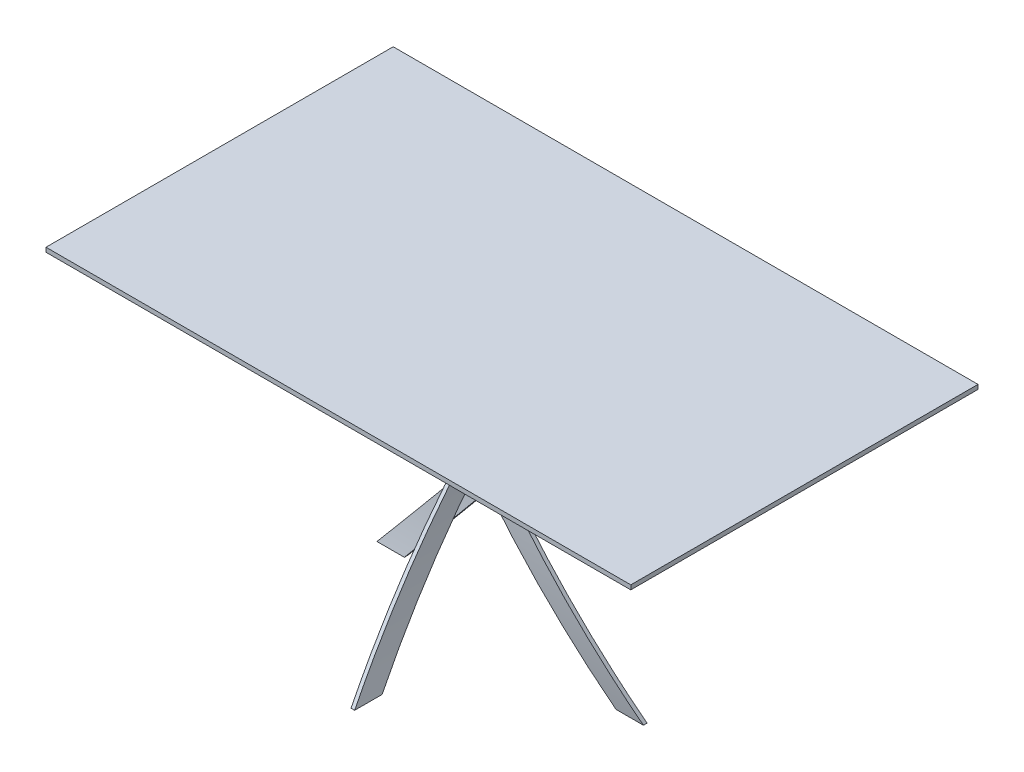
ISO-10303-21;
HEADER;
FILE_DESCRIPTION(('STEP AP214'),'2;1');
FILE_NAME('part.step','',(''),(''),'','','');
FILE_SCHEMA(('AUTOMOTIVE_DESIGN { 1 0 10303 214 1 1 1 1 }'));
ENDSEC;
DATA;
#1=APPLICATION_CONTEXT('core data for automotive mechanical design processes');
#2=APPLICATION_PROTOCOL_DEFINITION('international standard','automotive_design',2000,#1);
#3=PRODUCT_CONTEXT('',#1,'mechanical');
#4=PRODUCT('Part','Part','',(#3));
#5=PRODUCT_RELATED_PRODUCT_CATEGORY('part','',(#4));
#6=PRODUCT_DEFINITION_FORMATION('','',#4);
#7=PRODUCT_DEFINITION_CONTEXT('part definition',#1,'design');
#8=PRODUCT_DEFINITION('design','',#6,#7);
#9=PRODUCT_DEFINITION_SHAPE('','',#8);
#10=(LENGTH_UNIT() NAMED_UNIT(*) SI_UNIT(.MILLI.,.METRE.));
#11=(NAMED_UNIT(*) PLANE_ANGLE_UNIT() SI_UNIT($,.RADIAN.));
#12=(NAMED_UNIT(*) SI_UNIT($,.STERADIAN.) SOLID_ANGLE_UNIT());
#13=UNCERTAINTY_MEASURE_WITH_UNIT(LENGTH_MEASURE(1.E-05),#10,'distance_accuracy_value','');
#14=(GEOMETRIC_REPRESENTATION_CONTEXT(3) GLOBAL_UNCERTAINTY_ASSIGNED_CONTEXT((#13)) GLOBAL_UNIT_ASSIGNED_CONTEXT((#10,
#11,#12)) REPRESENTATION_CONTEXT('',''));
#15=CARTESIAN_POINT('',(0.,0.,0.));
#16=DIRECTION('',(0.,0.,1.));
#17=DIRECTION('',(1.,0.,0.));
#18=AXIS2_PLACEMENT_3D('',#15,#16,#17);
#19=CARTESIAN_POINT('',(1721.56180703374,370.,500.000000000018));
#20=DIRECTION('',(0.,0.,-1.));
#21=DIRECTION('',(-1.,0.,0.));
#22=AXIS2_PLACEMENT_3D('',#19,#20,#21);
#23=CYLINDRICAL_SURFACE('',#22,1800.);
#24=DIRECTION('',(0.,0.,-1.));
#25=VECTOR('',#24,1.);
#26=CARTESIAN_POINT('',(-40.4188966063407,1.99999999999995,499.999999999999));
#27=LINE('',#26,#25);
#28=CARTESIAN_POINT('',(-40.4188966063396,1.99999999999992,399.994999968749));
#29=VERTEX_POINT('',#28);
#30=CARTESIAN_POINT('',(-40.418896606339,1.99999999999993,324.994999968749));
#31=VERTEX_POINT('',#30);
#32=EDGE_CURVE('E70',#29,#31,#27,.T.);
#33=ORIENTED_EDGE('',*,*,#32,.F.);
#34=CARTESIAN_POINT('',(1721.56180703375,370.,100.808008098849));
#35=DIRECTION('',(0.,0.63083008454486,0.775921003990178));
#36=DIRECTION('',(0.,0.775921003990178,-0.63083008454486));
#37=AXIS2_PLACEMENT_3D('',#34,#35,#36);
#38=ELLIPSE('',#37,2319.82378456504,1800.);
#39=CARTESIAN_POINT('',(-39.9999999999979,740.,-200.005000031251));
#40=VERTEX_POINT('',#39);
#41=EDGE_CURVE('E90',#40,#29,#38,.T.);
#42=ORIENTED_EDGE('',*,*,#41,.F.);
#43=CARTESIAN_POINT('',(1721.56180703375,370.,-200.005000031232));
#44=DIRECTION('',(0.,0.,-1.));
#45=DIRECTION('',(-1.,0.,0.));
#46=AXIS2_PLACEMENT_3D('',#43,#44,#45);
#47=CIRCLE('',#46,1800.);
#48=CARTESIAN_POINT('',(-56.8799090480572,647.75,-200.005000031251));
#49=VERTEX_POINT('',#48);
#50=EDGE_CURVE('E87',#49,#40,#47,.T.);
#51=ORIENTED_EDGE('',*,*,#50,.F.);
#52=CARTESIAN_POINT('',(1721.56180703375,370.,25.808008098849));
#53=DIRECTION('',(0.,-0.63083008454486,-0.775921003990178));
#54=DIRECTION('',(0.,0.775921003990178,-0.63083008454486));
#55=AXIS2_PLACEMENT_3D('',#52,#53,#54);
#56=ELLIPSE('',#55,2319.82378456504,1800.);
#57=EDGE_CURVE('E50',#31,#49,#56,.T.);
#58=ORIENTED_EDGE('',*,*,#57,.F.);
#59=EDGE_LOOP('',(#33,#42,#51,#58));
#60=FACE_BOUND('',#59,.T.);
#61=ADVANCED_FACE('F46',(#60),#23,.T.);
#62=CARTESIAN_POINT('',(-300.000000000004,1.99999999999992,399.994999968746));
#63=DIRECTION('',(0.,0.63083008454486,0.775921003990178));
#64=DIRECTION('',(0.,-0.775921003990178,0.63083008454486));
#65=AXIS2_PLACEMENT_3D('',#62,#63,#64);
#66=PLANE('',#65);
#67=DIRECTION('',(1.,0.,0.));
#68=VECTOR('',#67,1.);
#69=CARTESIAN_POINT('',(-299.999999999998,740.,-200.005000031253));
#70=LINE('',#69,#68);
#71=CARTESIAN_POINT('',(-29.9999999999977,740.,-200.005000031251));
#72=VERTEX_POINT('',#71);
#73=EDGE_CURVE('E110',#40,#72,#70,.T.);
#74=ORIENTED_EDGE('',*,*,#73,.F.);
#75=ORIENTED_EDGE('',*,*,#41,.T.);
#76=DIRECTION('',(1.,0.,0.));
#77=VECTOR('',#76,1.);
#78=CARTESIAN_POINT('',(-300.000000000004,1.99999999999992,399.994999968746));
#79=LINE('',#78,#77);
#80=CARTESIAN_POINT('',(-30.4188966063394,1.99999999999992,399.994999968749));
#81=VERTEX_POINT('',#80);
#82=EDGE_CURVE('E104',#29,#81,#79,.T.);
#83=ORIENTED_EDGE('',*,*,#82,.T.);
#84=CARTESIAN_POINT('',(1731.56180703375,370.,100.808008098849));
#85=DIRECTION('',(0.,0.63083008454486,0.775921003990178));
#86=DIRECTION('',(0.,0.775921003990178,-0.63083008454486));
#87=AXIS2_PLACEMENT_3D('',#84,#85,#86);
#88=ELLIPSE('',#87,2319.82378456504,1800.);
#89=EDGE_CURVE('E95',#81,#72,#88,.F.);
#90=ORIENTED_EDGE('',*,*,#89,.T.);
#91=EDGE_LOOP('',(#74,#75,#83,#90));
#92=FACE_BOUND('',#91,.T.);
#93=ADVANCED_FACE('F119',(#92),#66,.T.);
#94=CARTESIAN_POINT('',(-299.999999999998,647.75,-200.005000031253));
#95=DIRECTION('',(0.,-0.63083008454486,-0.775921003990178));
#96=DIRECTION('',(0.,0.775921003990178,-0.63083008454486));
#97=AXIS2_PLACEMENT_3D('',#94,#95,#96);
#98=PLANE('',#97);
#99=DIRECTION('',(1.,0.,0.));
#100=VECTOR('',#99,1.);
#101=CARTESIAN_POINT('',(-300.000000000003,1.99999999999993,324.994999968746));
#102=LINE('',#101,#100);
#103=CARTESIAN_POINT('',(-30.4188966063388,1.99999999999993,324.994999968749));
#104=VERTEX_POINT('',#103);
#105=EDGE_CURVE('E12',#31,#104,#102,.T.);
#106=ORIENTED_EDGE('',*,*,#105,.F.);
#107=ORIENTED_EDGE('',*,*,#57,.T.);
#108=DIRECTION('',(1.,0.,0.));
#109=VECTOR('',#108,1.);
#110=CARTESIAN_POINT('',(-299.999999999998,647.75,-200.005000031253));
#111=LINE('',#110,#109);
#112=CARTESIAN_POINT('',(-46.879909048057,647.75,-200.005000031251));
#113=VERTEX_POINT('',#112);
#114=EDGE_CURVE('E55',#49,#113,#111,.T.);
#115=ORIENTED_EDGE('',*,*,#114,.T.);
#116=CARTESIAN_POINT('',(1731.56180703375,370.,25.8080080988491));
#117=DIRECTION('',(0.,-0.63083008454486,-0.775921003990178));
#118=DIRECTION('',(0.,0.775921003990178,-0.63083008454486));
#119=AXIS2_PLACEMENT_3D('',#116,#117,#118);
#120=ELLIPSE('',#119,2319.82378456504,1800.);
#121=EDGE_CURVE('E100',#113,#104,#120,.F.);
#122=ORIENTED_EDGE('',*,*,#121,.T.);
#123=EDGE_LOOP('',(#106,#107,#115,#122));
#124=FACE_BOUND('',#123,.T.);
#125=ADVANCED_FACE('F48',(#124),#98,.T.);
#126=CARTESIAN_POINT('',(-300.000000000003,1.99999999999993,324.994999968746));
#127=DIRECTION('',(0.,-1.,0.));
#128=DIRECTION('',(0.,0.,-1.));
#129=AXIS2_PLACEMENT_3D('',#126,#127,#128);
#130=PLANE('',#129);
#131=ORIENTED_EDGE('',*,*,#82,.F.);
#132=ORIENTED_EDGE('',*,*,#32,.T.);
#133=ORIENTED_EDGE('',*,*,#105,.T.);
#134=DIRECTION('',(0.,0.,-1.));
#135=VECTOR('',#134,1.);
#136=CARTESIAN_POINT('',(-30.4188966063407,1.99999999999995,500.));
#137=LINE('',#136,#135);
#138=EDGE_CURVE('E62',#104,#81,#137,.F.);
#139=ORIENTED_EDGE('',*,*,#138,.T.);
#140=EDGE_LOOP('',(#131,#132,#133,#139));
#141=FACE_BOUND('',#140,.T.);
#142=ADVANCED_FACE('F118',(#141),#130,.T.);
#143=CARTESIAN_POINT('',(-299.999999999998,740.,-200.005000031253));
#144=DIRECTION('',(0.,0.,-1.));
#145=DIRECTION('',(-1.,0.,0.));
#146=AXIS2_PLACEMENT_3D('',#143,#144,#145);
#147=PLANE('',#146);
#148=ORIENTED_EDGE('',*,*,#114,.F.);
#149=ORIENTED_EDGE('',*,*,#50,.T.);
#150=ORIENTED_EDGE('',*,*,#73,.T.);
#151=CARTESIAN_POINT('',(1731.56180703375,370.,-200.005000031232));
#152=DIRECTION('',(0.,0.,-1.));
#153=DIRECTION('',(-1.,0.,0.));
#154=AXIS2_PLACEMENT_3D('',#151,#152,#153);
#155=CIRCLE('',#154,1800.);
#156=EDGE_CURVE('E96',#72,#113,#155,.F.);
#157=ORIENTED_EDGE('',*,*,#156,.T.);
#158=EDGE_LOOP('',(#148,#149,#150,#157));
#159=FACE_BOUND('',#158,.T.);
#160=ADVANCED_FACE('F101',(#159),#147,.T.);
#161=CARTESIAN_POINT('',(1731.56180703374,370.,500.000000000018));
#162=DIRECTION('',(0.,0.,-1.));
#163=DIRECTION('',(-1.,0.,0.));
#164=AXIS2_PLACEMENT_3D('',#161,#162,#163);
#165=CYLINDRICAL_SURFACE('',#164,1800.);
#166=ORIENTED_EDGE('',*,*,#138,.F.);
#167=ORIENTED_EDGE('',*,*,#121,.F.);
#168=ORIENTED_EDGE('',*,*,#156,.F.);
#169=ORIENTED_EDGE('',*,*,#89,.F.);
#170=EDGE_LOOP('',(#166,#167,#168,#169));
#171=FACE_BOUND('',#170,.T.);
#172=ADVANCED_FACE('F122',(#171),#165,.F.);
#173=CLOSED_SHELL('',(#61,#93,#125,#142,#160,#172));
#174=MANIFOLD_SOLID_BREP('B2',#173);
#175=CARTESIAN_POINT('',(500.,370.,-1721.56180703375));
#176=DIRECTION('',(-1.,0.,0.));
#177=DIRECTION('',(0.,0.,1.));
#178=AXIS2_PLACEMENT_3D('',#175,#176,#177);
#179=CYLINDRICAL_SURFACE('',#178,1800.);
#180=DIRECTION('',(-1.,0.,0.));
#181=VECTOR('',#180,1.);
#182=CARTESIAN_POINT('',(500.,1.99999999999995,40.4188966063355));
#183=LINE('',#182,#181);
#184=CARTESIAN_POINT('',(399.99499996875,1.99999999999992,40.4188966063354));
#185=VERTEX_POINT('',#184);
#186=CARTESIAN_POINT('',(324.99499996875,1.99999999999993,40.4188966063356));
#187=VERTEX_POINT('',#186);
#188=EDGE_CURVE('E216',#185,#187,#183,.T.);
#189=ORIENTED_EDGE('',*,*,#188,.F.);
#190=CARTESIAN_POINT('',(100.808008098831,370.,-1721.56180703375));
#191=DIRECTION('',(0.775921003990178,0.63083008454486,0.));
#192=DIRECTION('',(-0.63083008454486,0.775921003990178,0.));
#193=AXIS2_PLACEMENT_3D('',#190,#191,#192);
#194=ELLIPSE('',#193,2319.82378456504,1800.);
#195=CARTESIAN_POINT('',(-200.00500003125,740.,40.));
#196=VERTEX_POINT('',#195);
#197=EDGE_CURVE('E236',#196,#185,#194,.T.);
#198=ORIENTED_EDGE('',*,*,#197,.F.);
#199=CARTESIAN_POINT('',(-200.00500003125,370.,-1721.56180703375));
#200=DIRECTION('',(-1.,0.,0.));
#201=DIRECTION('',(0.,0.,1.));
#202=AXIS2_PLACEMENT_3D('',#199,#200,#201);
#203=CIRCLE('',#202,1800.);
#204=CARTESIAN_POINT('',(-200.00500003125,647.75,56.8799090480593));
#205=VERTEX_POINT('',#204);
#206=EDGE_CURVE('E233',#205,#196,#203,.T.);
#207=ORIENTED_EDGE('',*,*,#206,.F.);
#208=CARTESIAN_POINT('',(25.808008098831,370.,-1721.56180703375));
#209=DIRECTION('',(-0.775921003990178,-0.63083008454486,0.));
#210=DIRECTION('',(-0.63083008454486,0.775921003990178,0.));
#211=AXIS2_PLACEMENT_3D('',#208,#209,#210);
#212=ELLIPSE('',#211,2319.82378456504,1800.);
#213=EDGE_CURVE('E196',#187,#205,#212,.T.);
#214=ORIENTED_EDGE('',*,*,#213,.F.);
#215=EDGE_LOOP('',(#189,#198,#207,#214));
#216=FACE_BOUND('',#215,.T.);
#217=ADVANCED_FACE('F192',(#216),#179,.T.);
#218=CARTESIAN_POINT('',(399.99499996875,1.99999999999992,300.));
#219=DIRECTION('',(0.775921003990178,0.63083008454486,0.));
#220=DIRECTION('',(0.63083008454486,-0.775921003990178,0.));
#221=AXIS2_PLACEMENT_3D('',#218,#219,#220);
#222=PLANE('',#221);
#223=DIRECTION('',(0.,0.,-1.));
#224=VECTOR('',#223,1.);
#225=CARTESIAN_POINT('',(-200.00500003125,740.,300.));
#226=LINE('',#225,#224);
#227=CARTESIAN_POINT('',(-200.00500003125,740.,29.9999999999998));
#228=VERTEX_POINT('',#227);
#229=EDGE_CURVE('E256',#196,#228,#226,.T.);
#230=ORIENTED_EDGE('',*,*,#229,.F.);
#231=ORIENTED_EDGE('',*,*,#197,.T.);
#232=DIRECTION('',(0.,0.,-1.));
#233=VECTOR('',#232,1.);
#234=CARTESIAN_POINT('',(399.99499996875,1.99999999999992,300.));
#235=LINE('',#234,#233);
#236=CARTESIAN_POINT('',(399.99499996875,1.99999999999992,30.4188966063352));
#237=VERTEX_POINT('',#236);
#238=EDGE_CURVE('E250',#185,#237,#235,.T.);
#239=ORIENTED_EDGE('',*,*,#238,.T.);
#240=CARTESIAN_POINT('',(100.808008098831,370.,-1731.56180703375));
#241=DIRECTION('',(0.775921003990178,0.63083008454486,0.));
#242=DIRECTION('',(-0.63083008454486,0.775921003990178,0.));
#243=AXIS2_PLACEMENT_3D('',#240,#241,#242);
#244=ELLIPSE('',#243,2319.82378456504,1800.);
#245=EDGE_CURVE('E241',#237,#228,#244,.F.);
#246=ORIENTED_EDGE('',*,*,#245,.T.);
#247=EDGE_LOOP('',(#230,#231,#239,#246));
#248=FACE_BOUND('',#247,.T.);
#249=ADVANCED_FACE('F265',(#248),#222,.T.);
#250=CARTESIAN_POINT('',(-200.00500003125,647.75,300.));
#251=DIRECTION('',(-0.775921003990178,-0.63083008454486,0.));
#252=DIRECTION('',(-0.63083008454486,0.775921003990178,0.));
#253=AXIS2_PLACEMENT_3D('',#250,#251,#252);
#254=PLANE('',#253);
#255=DIRECTION('',(0.,0.,-1.));
#256=VECTOR('',#255,1.);
#257=CARTESIAN_POINT('',(324.99499996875,1.99999999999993,300.));
#258=LINE('',#257,#256);
#259=CARTESIAN_POINT('',(324.99499996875,1.99999999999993,30.4188966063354));
#260=VERTEX_POINT('',#259);
#261=EDGE_CURVE('E44',#187,#260,#258,.T.);
#262=ORIENTED_EDGE('',*,*,#261,.F.);
#263=ORIENTED_EDGE('',*,*,#213,.T.);
#264=DIRECTION('',(0.,0.,-1.));
#265=VECTOR('',#264,1.);
#266=CARTESIAN_POINT('',(-200.00500003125,647.75,300.));
#267=LINE('',#266,#265);
#268=CARTESIAN_POINT('',(-200.00500003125,647.75,46.8799090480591));
#269=VERTEX_POINT('',#268);
#270=EDGE_CURVE('E201',#205,#269,#267,.T.);
#271=ORIENTED_EDGE('',*,*,#270,.T.);
#272=CARTESIAN_POINT('',(25.808008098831,370.,-1731.56180703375));
#273=DIRECTION('',(-0.775921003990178,-0.63083008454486,0.));
#274=DIRECTION('',(-0.63083008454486,0.775921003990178,0.));
#275=AXIS2_PLACEMENT_3D('',#272,#273,#274);
#276=ELLIPSE('',#275,2319.82378456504,1800.);
#277=EDGE_CURVE('E246',#269,#260,#276,.F.);
#278=ORIENTED_EDGE('',*,*,#277,.T.);
#279=EDGE_LOOP('',(#262,#263,#271,#278));
#280=FACE_BOUND('',#279,.T.);
#281=ADVANCED_FACE('F194',(#280),#254,.T.);
#282=CARTESIAN_POINT('',(324.99499996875,1.99999999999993,300.));
#283=DIRECTION('',(0.,-1.,0.));
#284=DIRECTION('',(-1.,0.,0.));
#285=AXIS2_PLACEMENT_3D('',#282,#283,#284);
#286=PLANE('',#285);
#287=ORIENTED_EDGE('',*,*,#238,.F.);
#288=ORIENTED_EDGE('',*,*,#188,.T.);
#289=ORIENTED_EDGE('',*,*,#261,.T.);
#290=DIRECTION('',(-1.,0.,0.));
#291=VECTOR('',#290,1.);
#292=CARTESIAN_POINT('',(500.,1.99999999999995,30.4188966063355));
#293=LINE('',#292,#291);
#294=EDGE_CURVE('E208',#260,#237,#293,.F.);
#295=ORIENTED_EDGE('',*,*,#294,.T.);
#296=EDGE_LOOP('',(#287,#288,#289,#295));
#297=FACE_BOUND('',#296,.T.);
#298=ADVANCED_FACE('F264',(#297),#286,.T.);
#299=CARTESIAN_POINT('',(-200.00500003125,740.,300.));
#300=DIRECTION('',(-1.,0.,0.));
#301=DIRECTION('',(0.,0.,1.));
#302=AXIS2_PLACEMENT_3D('',#299,#300,#301);
#303=PLANE('',#302);
#304=ORIENTED_EDGE('',*,*,#270,.F.);
#305=ORIENTED_EDGE('',*,*,#206,.T.);
#306=ORIENTED_EDGE('',*,*,#229,.T.);
#307=CARTESIAN_POINT('',(-200.00500003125,370.,-1731.56180703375));
#308=DIRECTION('',(-1.,0.,0.));
#309=DIRECTION('',(0.,0.,1.));
#310=AXIS2_PLACEMENT_3D('',#307,#308,#309);
#311=CIRCLE('',#310,1800.);
#312=EDGE_CURVE('E242',#228,#269,#311,.F.);
#313=ORIENTED_EDGE('',*,*,#312,.T.);
#314=EDGE_LOOP('',(#304,#305,#306,#313));
#315=FACE_BOUND('',#314,.T.);
#316=ADVANCED_FACE('F247',(#315),#303,.T.);
#317=CARTESIAN_POINT('',(500.,370.,-1731.56180703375));
#318=DIRECTION('',(-1.,0.,0.));
#319=DIRECTION('',(0.,0.,1.));
#320=AXIS2_PLACEMENT_3D('',#317,#318,#319);
#321=CYLINDRICAL_SURFACE('',#320,1800.);
#322=ORIENTED_EDGE('',*,*,#294,.F.);
#323=ORIENTED_EDGE('',*,*,#277,.F.);
#324=ORIENTED_EDGE('',*,*,#312,.F.);
#325=ORIENTED_EDGE('',*,*,#245,.F.);
#326=EDGE_LOOP('',(#322,#323,#324,#325));
#327=FACE_BOUND('',#326,.T.);
#328=ADVANCED_FACE('F268',(#327),#321,.F.);
#329=CLOSED_SHELL('',(#217,#249,#281,#298,#316,#328));
#330=MANIFOLD_SOLID_BREP('B6',#329);
#331=CARTESIAN_POINT('',(-1721.56180703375,370.,-500.000000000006));
#332=DIRECTION('',(0.,0.,1.));
#333=DIRECTION('',(1.,0.,0.));
#334=AXIS2_PLACEMENT_3D('',#331,#332,#333);
#335=CYLINDRICAL_SURFACE('',#334,1800.);
#336=DIRECTION('',(0.,0.,1.));
#337=VECTOR('',#336,1.);
#338=CARTESIAN_POINT('',(40.4188966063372,1.99999999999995,-500.));
#339=LINE('',#338,#337);
#340=CARTESIAN_POINT('',(40.4188966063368,1.99999999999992,-399.994999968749));
#341=VERTEX_POINT('',#340);
#342=CARTESIAN_POINT('',(40.4188966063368,1.99999999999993,-324.994999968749));
#343=VERTEX_POINT('',#342);
#344=EDGE_CURVE('E362',#341,#343,#339,.T.);
#345=ORIENTED_EDGE('',*,*,#344,.F.);
#346=CARTESIAN_POINT('',(-1721.56180703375,370.,-100.808008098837));
#347=DIRECTION('',(0.,0.63083008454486,-0.775921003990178));
#348=DIRECTION('',(0.,0.775921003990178,0.63083008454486));
#349=AXIS2_PLACEMENT_3D('',#346,#347,#348);
#350=ELLIPSE('',#349,2319.82378456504,1800.);
#351=CARTESIAN_POINT('',(39.9999999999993,740.,200.00500003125));
#352=VERTEX_POINT('',#351);
#353=EDGE_CURVE('E382',#352,#341,#350,.T.);
#354=ORIENTED_EDGE('',*,*,#353,.F.);
#355=CARTESIAN_POINT('',(-1721.56180703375,370.,200.005000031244));
#356=DIRECTION('',(0.,0.,1.));
#357=DIRECTION('',(1.,0.,0.));
#358=AXIS2_PLACEMENT_3D('',#355,#356,#357);
#359=CIRCLE('',#358,1800.);
#360=CARTESIAN_POINT('',(56.8799090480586,647.75,200.00500003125));
#361=VERTEX_POINT('',#360);
#362=EDGE_CURVE('E379',#361,#352,#359,.T.);
#363=ORIENTED_EDGE('',*,*,#362,.F.);
#364=CARTESIAN_POINT('',(-1721.56180703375,370.,-25.808008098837));
#365=DIRECTION('',(0.,-0.63083008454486,0.775921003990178));
#366=DIRECTION('',(0.,0.775921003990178,0.63083008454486));
#367=AXIS2_PLACEMENT_3D('',#364,#365,#366);
#368=ELLIPSE('',#367,2319.82378456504,1800.);
#369=EDGE_CURVE('E342',#343,#361,#368,.T.);
#370=ORIENTED_EDGE('',*,*,#369,.F.);
#371=EDGE_LOOP('',(#345,#354,#363,#370));
#372=FACE_BOUND('',#371,.T.);
#373=ADVANCED_FACE('F338',(#372),#335,.T.);
#374=CARTESIAN_POINT('',(300.000000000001,1.99999999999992,-399.994999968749));
#375=DIRECTION('',(0.,0.63083008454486,-0.775921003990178));
#376=DIRECTION('',(0.,-0.775921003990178,-0.63083008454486));
#377=AXIS2_PLACEMENT_3D('',#374,#375,#376);
#378=PLANE('',#377);
#379=DIRECTION('',(-1.,0.,0.));
#380=VECTOR('',#379,1.);
#381=CARTESIAN_POINT('',(299.999999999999,740.,200.005000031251));
#382=LINE('',#381,#380);
#383=CARTESIAN_POINT('',(29.9999999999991,740.,200.00500003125));
#384=VERTEX_POINT('',#383);
#385=EDGE_CURVE('E402',#352,#384,#382,.T.);
#386=ORIENTED_EDGE('',*,*,#385,.F.);
#387=ORIENTED_EDGE('',*,*,#353,.T.);
#388=DIRECTION('',(-1.,0.,0.));
#389=VECTOR('',#388,1.);
#390=CARTESIAN_POINT('',(300.000000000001,1.99999999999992,-399.994999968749));
#391=LINE('',#390,#389);
#392=CARTESIAN_POINT('',(30.4188966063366,1.99999999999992,-399.99499996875));
#393=VERTEX_POINT('',#392);
#394=EDGE_CURVE('E396',#341,#393,#391,.T.);
#395=ORIENTED_EDGE('',*,*,#394,.T.);
#396=CARTESIAN_POINT('',(-1731.56180703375,370.,-100.808008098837));
#397=DIRECTION('',(0.,0.63083008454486,-0.775921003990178));
#398=DIRECTION('',(0.,0.775921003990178,0.63083008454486));
#399=AXIS2_PLACEMENT_3D('',#396,#397,#398);
#400=ELLIPSE('',#399,2319.82378456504,1800.);
#401=EDGE_CURVE('E387',#393,#384,#400,.F.);
#402=ORIENTED_EDGE('',*,*,#401,.T.);
#403=EDGE_LOOP('',(#386,#387,#395,#402));
#404=FACE_BOUND('',#403,.T.);
#405=ADVANCED_FACE('F411',(#404),#378,.T.);
#406=CARTESIAN_POINT('',(299.999999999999,647.75,200.005000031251));
#407=DIRECTION('',(0.,-0.63083008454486,0.775921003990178));
#408=DIRECTION('',(0.,0.775921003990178,0.63083008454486));
#409=AXIS2_PLACEMENT_3D('',#406,#407,#408);
#410=PLANE('',#409);
#411=DIRECTION('',(-1.,0.,0.));
#412=VECTOR('',#411,1.);
#413=CARTESIAN_POINT('',(300.000000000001,1.99999999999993,-324.994999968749));
#414=LINE('',#413,#412);
#415=CARTESIAN_POINT('',(30.4188966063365,1.99999999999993,-324.99499996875));
#416=VERTEX_POINT('',#415);
#417=EDGE_CURVE('E190',#343,#416,#414,.T.);
#418=ORIENTED_EDGE('',*,*,#417,.F.);
#419=ORIENTED_EDGE('',*,*,#369,.T.);
#420=DIRECTION('',(-1.,0.,0.));
#421=VECTOR('',#420,1.);
#422=CARTESIAN_POINT('',(299.999999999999,647.75,200.005000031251));
#423=LINE('',#422,#421);
#424=CARTESIAN_POINT('',(46.8799090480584,647.75,200.00500003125));
#425=VERTEX_POINT('',#424);
#426=EDGE_CURVE('E347',#361,#425,#423,.T.);
#427=ORIENTED_EDGE('',*,*,#426,.T.);
#428=CARTESIAN_POINT('',(-1731.56180703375,370.,-25.808008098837));
#429=DIRECTION('',(0.,-0.63083008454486,0.775921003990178));
#430=DIRECTION('',(0.,0.775921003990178,0.63083008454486));
#431=AXIS2_PLACEMENT_3D('',#428,#429,#430);
#432=ELLIPSE('',#431,2319.82378456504,1800.);
#433=EDGE_CURVE('E392',#425,#416,#432,.F.);
#434=ORIENTED_EDGE('',*,*,#433,.T.);
#435=EDGE_LOOP('',(#418,#419,#427,#434));
#436=FACE_BOUND('',#435,.T.);
#437=ADVANCED_FACE('F340',(#436),#410,.T.);
#438=CARTESIAN_POINT('',(300.000000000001,1.99999999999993,-324.994999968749));
#439=DIRECTION('',(0.,-1.,0.));
#440=DIRECTION('',(0.,0.,1.));
#441=AXIS2_PLACEMENT_3D('',#438,#439,#440);
#442=PLANE('',#441);
#443=ORIENTED_EDGE('',*,*,#394,.F.);
#444=ORIENTED_EDGE('',*,*,#344,.T.);
#445=ORIENTED_EDGE('',*,*,#417,.T.);
#446=DIRECTION('',(0.,0.,1.));
#447=VECTOR('',#446,1.);
#448=CARTESIAN_POINT('',(30.4188966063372,1.99999999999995,-500.));
#449=LINE('',#448,#447);
#450=EDGE_CURVE('E354',#416,#393,#449,.F.);
#451=ORIENTED_EDGE('',*,*,#450,.T.);
#452=EDGE_LOOP('',(#443,#444,#445,#451));
#453=FACE_BOUND('',#452,.T.);
#454=ADVANCED_FACE('F410',(#453),#442,.T.);
#455=CARTESIAN_POINT('',(299.999999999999,740.,200.005000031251));
#456=DIRECTION('',(0.,0.,1.));
#457=DIRECTION('',(1.,0.,0.));
#458=AXIS2_PLACEMENT_3D('',#455,#456,#457);
#459=PLANE('',#458);
#460=ORIENTED_EDGE('',*,*,#426,.F.);
#461=ORIENTED_EDGE('',*,*,#362,.T.);
#462=ORIENTED_EDGE('',*,*,#385,.T.);
#463=CARTESIAN_POINT('',(-1731.56180703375,370.,200.005000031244));
#464=DIRECTION('',(0.,0.,1.));
#465=DIRECTION('',(1.,0.,0.));
#466=AXIS2_PLACEMENT_3D('',#463,#464,#465);
#467=CIRCLE('',#466,1800.);
#468=EDGE_CURVE('E388',#384,#425,#467,.F.);
#469=ORIENTED_EDGE('',*,*,#468,.T.);
#470=EDGE_LOOP('',(#460,#461,#462,#469));
#471=FACE_BOUND('',#470,.T.);
#472=ADVANCED_FACE('F393',(#471),#459,.T.);
#473=CARTESIAN_POINT('',(-1731.56180703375,370.,-500.000000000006));
#474=DIRECTION('',(0.,0.,1.));
#475=DIRECTION('',(1.,0.,0.));
#476=AXIS2_PLACEMENT_3D('',#473,#474,#475);
#477=CYLINDRICAL_SURFACE('',#476,1800.);
#478=ORIENTED_EDGE('',*,*,#450,.F.);
#479=ORIENTED_EDGE('',*,*,#433,.F.);
#480=ORIENTED_EDGE('',*,*,#468,.F.);
#481=ORIENTED_EDGE('',*,*,#401,.F.);
#482=EDGE_LOOP('',(#478,#479,#480,#481));
#483=FACE_BOUND('',#482,.T.);
#484=ADVANCED_FACE('F414',(#483),#477,.F.);
#485=CLOSED_SHELL('',(#373,#405,#437,#454,#472,#484));
#486=MANIFOLD_SOLID_BREP('B38',#485);
#487=CARTESIAN_POINT('',(-500.,370.,1721.56180703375));
#488=DIRECTION('',(1.,0.,0.));
#489=DIRECTION('',(0.,0.,-1.));
#490=AXIS2_PLACEMENT_3D('',#487,#488,#489);
#491=CYLINDRICAL_SURFACE('',#490,1800.);
#492=DIRECTION('',(1.,0.,0.));
#493=VECTOR('',#492,1.);
#494=CARTESIAN_POINT('',(-500.,1.99999999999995,-40.4188966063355));
#495=LINE('',#494,#493);
#496=CARTESIAN_POINT('',(-399.99499996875,1.99999999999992,-40.4188966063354));
#497=VERTEX_POINT('',#496);
#498=CARTESIAN_POINT('',(-324.99499996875,1.99999999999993,-40.4188966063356));
#499=VERTEX_POINT('',#498);
#500=EDGE_CURVE('E507',#497,#499,#495,.T.);
#501=ORIENTED_EDGE('',*,*,#500,.F.);
#502=CARTESIAN_POINT('',(-100.808008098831,370.,1721.56180703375));
#503=DIRECTION('',(-0.775921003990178,0.63083008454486,0.));
#504=DIRECTION('',(0.63083008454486,0.775921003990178,0.));
#505=AXIS2_PLACEMENT_3D('',#502,#503,#504);
#506=ELLIPSE('',#505,2319.82378456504,1800.);
#507=CARTESIAN_POINT('',(200.00500003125,740.,-40.));
#508=VERTEX_POINT('',#507);
#509=EDGE_CURVE('E527',#508,#497,#506,.T.);
#510=ORIENTED_EDGE('',*,*,#509,.F.);
#511=CARTESIAN_POINT('',(200.00500003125,370.,1721.56180703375));
#512=DIRECTION('',(1.,0.,0.));
#513=DIRECTION('',(0.,0.,-1.));
#514=AXIS2_PLACEMENT_3D('',#511,#512,#513);
#515=CIRCLE('',#514,1800.);
#516=CARTESIAN_POINT('',(200.00500003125,647.75,-56.8799090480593));
#517=VERTEX_POINT('',#516);
#518=EDGE_CURVE('E524',#517,#508,#515,.T.);
#519=ORIENTED_EDGE('',*,*,#518,.F.);
#520=CARTESIAN_POINT('',(-25.808008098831,370.,1721.56180703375));
#521=DIRECTION('',(0.775921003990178,-0.63083008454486,0.));
#522=DIRECTION('',(0.63083008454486,0.775921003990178,0.));
#523=AXIS2_PLACEMENT_3D('',#520,#521,#522);
#524=ELLIPSE('',#523,2319.82378456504,1800.);
#525=EDGE_CURVE('E487',#499,#517,#524,.T.);
#526=ORIENTED_EDGE('',*,*,#525,.F.);
#527=EDGE_LOOP('',(#501,#510,#519,#526));
#528=FACE_BOUND('',#527,.T.);
#529=ADVANCED_FACE('F483',(#528),#491,.T.);
#530=CARTESIAN_POINT('',(-399.99499996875,1.99999999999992,-300.));
#531=DIRECTION('',(-0.775921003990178,0.63083008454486,0.));
#532=DIRECTION('',(-0.63083008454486,-0.775921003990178,0.));
#533=AXIS2_PLACEMENT_3D('',#530,#531,#532);
#534=PLANE('',#533);
#535=DIRECTION('',(0.,0.,1.));
#536=VECTOR('',#535,1.);
#537=CARTESIAN_POINT('',(200.00500003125,740.,-300.));
#538=LINE('',#537,#536);
#539=CARTESIAN_POINT('',(200.00500003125,740.,-29.9999999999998));
#540=VERTEX_POINT('',#539);
#541=EDGE_CURVE('E547',#508,#540,#538,.T.);
#542=ORIENTED_EDGE('',*,*,#541,.F.);
#543=ORIENTED_EDGE('',*,*,#509,.T.);
#544=DIRECTION('',(0.,0.,1.));
#545=VECTOR('',#544,1.);
#546=CARTESIAN_POINT('',(-399.99499996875,1.99999999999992,-300.));
#547=LINE('',#546,#545);
#548=CARTESIAN_POINT('',(-399.99499996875,1.99999999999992,-30.4188966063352));
#549=VERTEX_POINT('',#548);
#550=EDGE_CURVE('E541',#497,#549,#547,.T.);
#551=ORIENTED_EDGE('',*,*,#550,.T.);
#552=CARTESIAN_POINT('',(-100.808008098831,370.,1731.56180703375));
#553=DIRECTION('',(-0.775921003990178,0.63083008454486,0.));
#554=DIRECTION('',(0.63083008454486,0.775921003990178,0.));
#555=AXIS2_PLACEMENT_3D('',#552,#553,#554);
#556=ELLIPSE('',#555,2319.82378456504,1800.);
#557=EDGE_CURVE('E532',#549,#540,#556,.F.);
#558=ORIENTED_EDGE('',*,*,#557,.T.);
#559=EDGE_LOOP('',(#542,#543,#551,#558));
#560=FACE_BOUND('',#559,.T.);
#561=ADVANCED_FACE('F556',(#560),#534,.T.);
#562=CARTESIAN_POINT('',(200.00500003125,647.75,-300.));
#563=DIRECTION('',(0.775921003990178,-0.63083008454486,0.));
#564=DIRECTION('',(0.63083008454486,0.775921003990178,0.));
#565=AXIS2_PLACEMENT_3D('',#562,#563,#564);
#566=PLANE('',#565);
#567=DIRECTION('',(0.,0.,1.));
#568=VECTOR('',#567,1.);
#569=CARTESIAN_POINT('',(-324.99499996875,1.99999999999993,-300.));
#570=LINE('',#569,#568);
#571=CARTESIAN_POINT('',(-324.99499996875,1.99999999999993,-30.4188966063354));
#572=VERTEX_POINT('',#571);
#573=EDGE_CURVE('E336',#499,#572,#570,.T.);
#574=ORIENTED_EDGE('',*,*,#573,.F.);
#575=ORIENTED_EDGE('',*,*,#525,.T.);
#576=DIRECTION('',(0.,0.,1.));
#577=VECTOR('',#576,1.);
#578=CARTESIAN_POINT('',(200.00500003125,647.75,-300.));
#579=LINE('',#578,#577);
#580=CARTESIAN_POINT('',(200.00500003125,647.75,-46.8799090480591));
#581=VERTEX_POINT('',#580);
#582=EDGE_CURVE('E492',#517,#581,#579,.T.);
#583=ORIENTED_EDGE('',*,*,#582,.T.);
#584=CARTESIAN_POINT('',(-25.808008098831,370.,1731.56180703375));
#585=DIRECTION('',(0.775921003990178,-0.63083008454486,0.));
#586=DIRECTION('',(0.63083008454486,0.775921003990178,0.));
#587=AXIS2_PLACEMENT_3D('',#584,#585,#586);
#588=ELLIPSE('',#587,2319.82378456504,1800.);
#589=EDGE_CURVE('E537',#581,#572,#588,.F.);
#590=ORIENTED_EDGE('',*,*,#589,.T.);
#591=EDGE_LOOP('',(#574,#575,#583,#590));
#592=FACE_BOUND('',#591,.T.);
#593=ADVANCED_FACE('F485',(#592),#566,.T.);
#594=CARTESIAN_POINT('',(-324.99499996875,1.99999999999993,-300.));
#595=DIRECTION('',(0.,-1.,0.));
#596=DIRECTION('',(1.,0.,0.));
#597=AXIS2_PLACEMENT_3D('',#594,#595,#596);
#598=PLANE('',#597);
#599=ORIENTED_EDGE('',*,*,#550,.F.);
#600=ORIENTED_EDGE('',*,*,#500,.T.);
#601=ORIENTED_EDGE('',*,*,#573,.T.);
#602=DIRECTION('',(1.,0.,0.));
#603=VECTOR('',#602,1.);
#604=CARTESIAN_POINT('',(-500.,1.99999999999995,-30.4188966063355));
#605=LINE('',#604,#603);
#606=EDGE_CURVE('E499',#572,#549,#605,.F.);
#607=ORIENTED_EDGE('',*,*,#606,.T.);
#608=EDGE_LOOP('',(#599,#600,#601,#607));
#609=FACE_BOUND('',#608,.T.);
#610=ADVANCED_FACE('F555',(#609),#598,.T.);
#611=CARTESIAN_POINT('',(200.00500003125,740.,-300.));
#612=DIRECTION('',(1.,0.,0.));
#613=DIRECTION('',(0.,0.,-1.));
#614=AXIS2_PLACEMENT_3D('',#611,#612,#613);
#615=PLANE('',#614);
#616=ORIENTED_EDGE('',*,*,#582,.F.);
#617=ORIENTED_EDGE('',*,*,#518,.T.);
#618=ORIENTED_EDGE('',*,*,#541,.T.);
#619=CARTESIAN_POINT('',(200.00500003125,370.,1731.56180703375));
#620=DIRECTION('',(1.,0.,0.));
#621=DIRECTION('',(0.,0.,-1.));
#622=AXIS2_PLACEMENT_3D('',#619,#620,#621);
#623=CIRCLE('',#622,1800.);
#624=EDGE_CURVE('E533',#540,#581,#623,.F.);
#625=ORIENTED_EDGE('',*,*,#624,.T.);
#626=EDGE_LOOP('',(#616,#617,#618,#625));
#627=FACE_BOUND('',#626,.T.);
#628=ADVANCED_FACE('F538',(#627),#615,.T.);
#629=CARTESIAN_POINT('',(-500.,370.,1731.56180703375));
#630=DIRECTION('',(1.,0.,0.));
#631=DIRECTION('',(0.,0.,-1.));
#632=AXIS2_PLACEMENT_3D('',#629,#630,#631);
#633=CYLINDRICAL_SURFACE('',#632,1800.);
#634=ORIENTED_EDGE('',*,*,#606,.F.);
#635=ORIENTED_EDGE('',*,*,#589,.F.);
#636=ORIENTED_EDGE('',*,*,#624,.F.);
#637=ORIENTED_EDGE('',*,*,#557,.F.);
#638=EDGE_LOOP('',(#634,#635,#636,#637));
#639=FACE_BOUND('',#638,.T.);
#640=ADVANCED_FACE('F559',(#639),#633,.F.);
#641=CLOSED_SHELL('',(#529,#561,#593,#610,#628,#640));
#642=MANIFOLD_SOLID_BREP('B184',#641);
#643=CARTESIAN_POINT('',(800.,752.,-475.));
#644=DIRECTION('',(-1.,0.,0.));
#645=DIRECTION('',(0.,0.,1.));
#646=AXIS2_PLACEMENT_3D('',#643,#644,#645);
#647=PLANE('',#646);
#648=DIRECTION('',(0.,0.,-1.));
#649=VECTOR('',#648,1.);
#650=CARTESIAN_POINT('',(800.,740.,-475.));
#651=LINE('',#650,#649);
#652=CARTESIAN_POINT('',(800.,740.,475.));
#653=VERTEX_POINT('',#652);
#654=CARTESIAN_POINT('',(800.,740.,-475.));
#655=VERTEX_POINT('',#654);
#656=EDGE_CURVE('E670',#653,#655,#651,.T.);
#657=ORIENTED_EDGE('',*,*,#656,.T.);
#658=DIRECTION('',(0.,-1.,0.));
#659=VECTOR('',#658,1.);
#660=CARTESIAN_POINT('',(800.,752.,-475.));
#661=LINE('',#660,#659);
#662=CARTESIAN_POINT('',(800.,752.,-475.));
#663=VERTEX_POINT('',#662);
#664=EDGE_CURVE('E481',#663,#655,#661,.T.);
#665=ORIENTED_EDGE('',*,*,#664,.F.);
#666=DIRECTION('',(0.,0.,-1.));
#667=VECTOR('',#666,1.);
#668=CARTESIAN_POINT('',(800.,752.,-475.));
#669=LINE('',#668,#667);
#670=CARTESIAN_POINT('',(800.,752.,475.));
#671=VERTEX_POINT('',#670);
#672=EDGE_CURVE('E658',#671,#663,#669,.T.);
#673=ORIENTED_EDGE('',*,*,#672,.F.);
#674=DIRECTION('',(0.,-1.,0.));
#675=VECTOR('',#674,1.);
#676=CARTESIAN_POINT('',(800.,752.,475.));
#677=LINE('',#676,#675);
#678=EDGE_CURVE('E666',#671,#653,#677,.T.);
#679=ORIENTED_EDGE('',*,*,#678,.T.);
#680=EDGE_LOOP('',(#657,#665,#673,#679));
#681=FACE_BOUND('',#680,.T.);
#682=ADVANCED_FACE('F607',(#681),#647,.F.);
#683=CARTESIAN_POINT('',(-800.,752.,-475.));
#684=DIRECTION('',(0.,0.,1.));
#685=DIRECTION('',(1.,0.,0.));
#686=AXIS2_PLACEMENT_3D('',#683,#684,#685);
#687=PLANE('',#686);
#688=DIRECTION('',(-1.,0.,0.));
#689=VECTOR('',#688,1.);
#690=CARTESIAN_POINT('',(-800.,740.,-475.));
#691=LINE('',#690,#689);
#692=CARTESIAN_POINT('',(-800.,740.,-475.));
#693=VERTEX_POINT('',#692);
#694=EDGE_CURVE('E662',#655,#693,#691,.T.);
#695=ORIENTED_EDGE('',*,*,#694,.T.);
#696=DIRECTION('',(0.,-1.,0.));
#697=VECTOR('',#696,1.);
#698=CARTESIAN_POINT('',(-800.,752.,-475.));
#699=LINE('',#698,#697);
#700=CARTESIAN_POINT('',(-800.,752.,-475.));
#701=VERTEX_POINT('',#700);
#702=EDGE_CURVE('E615',#701,#693,#699,.T.);
#703=ORIENTED_EDGE('',*,*,#702,.F.);
#704=DIRECTION('',(-1.,0.,0.));
#705=VECTOR('',#704,1.);
#706=CARTESIAN_POINT('',(-800.,752.,-475.));
#707=LINE('',#706,#705);
#708=EDGE_CURVE('E653',#663,#701,#707,.T.);
#709=ORIENTED_EDGE('',*,*,#708,.F.);
#710=ORIENTED_EDGE('',*,*,#664,.T.);
#711=EDGE_LOOP('',(#695,#703,#709,#710));
#712=FACE_BOUND('',#711,.T.);
#713=ADVANCED_FACE('F661',(#712),#687,.F.);
#714=CARTESIAN_POINT('',(-800.,752.,-475.));
#715=DIRECTION('',(1.,0.,0.));
#716=DIRECTION('',(0.,0.,-1.));
#717=AXIS2_PLACEMENT_3D('',#714,#715,#716);
#718=PLANE('',#717);
#719=DIRECTION('',(0.,0.,1.));
#720=VECTOR('',#719,1.);
#721=CARTESIAN_POINT('',(-800.,740.,-475.));
#722=LINE('',#721,#720);
#723=CARTESIAN_POINT('',(-800.,740.,475.));
#724=VERTEX_POINT('',#723);
#725=EDGE_CURVE('E640',#693,#724,#722,.T.);
#726=ORIENTED_EDGE('',*,*,#725,.T.);
#727=DIRECTION('',(0.,-1.,0.));
#728=VECTOR('',#727,1.);
#729=CARTESIAN_POINT('',(-800.,752.,475.));
#730=LINE('',#729,#728);
#731=CARTESIAN_POINT('',(-800.,752.,475.));
#732=VERTEX_POINT('',#731);
#733=EDGE_CURVE('E663',#732,#724,#730,.T.);
#734=ORIENTED_EDGE('',*,*,#733,.F.);
#735=DIRECTION('',(0.,0.,1.));
#736=VECTOR('',#735,1.);
#737=CARTESIAN_POINT('',(-800.,752.,-475.));
#738=LINE('',#737,#736);
#739=EDGE_CURVE('E656',#701,#732,#738,.T.);
#740=ORIENTED_EDGE('',*,*,#739,.F.);
#741=ORIENTED_EDGE('',*,*,#702,.T.);
#742=EDGE_LOOP('',(#726,#734,#740,#741));
#743=FACE_BOUND('',#742,.T.);
#744=ADVANCED_FACE('F664',(#743),#718,.F.);
#745=CARTESIAN_POINT('',(-800.,752.,475.));
#746=DIRECTION('',(0.,0.,-1.));
#747=DIRECTION('',(-1.,0.,0.));
#748=AXIS2_PLACEMENT_3D('',#745,#746,#747);
#749=PLANE('',#748);
#750=DIRECTION('',(1.,0.,0.));
#751=VECTOR('',#750,1.);
#752=CARTESIAN_POINT('',(-800.,740.,475.));
#753=LINE('',#752,#751);
#754=EDGE_CURVE('E646',#724,#653,#753,.T.);
#755=ORIENTED_EDGE('',*,*,#754,.T.);
#756=ORIENTED_EDGE('',*,*,#678,.F.);
#757=DIRECTION('',(1.,0.,0.));
#758=VECTOR('',#757,1.);
#759=CARTESIAN_POINT('',(-800.,752.,475.));
#760=LINE('',#759,#758);
#761=EDGE_CURVE('E623',#732,#671,#760,.T.);
#762=ORIENTED_EDGE('',*,*,#761,.F.);
#763=ORIENTED_EDGE('',*,*,#733,.T.);
#764=EDGE_LOOP('',(#755,#756,#762,#763));
#765=FACE_BOUND('',#764,.T.);
#766=ADVANCED_FACE('F677',(#765),#749,.F.);
#767=CARTESIAN_POINT('',(0.,752.,0.));
#768=DIRECTION('',(0.,1.,0.));
#769=DIRECTION('',(0.,0.,1.));
#770=AXIS2_PLACEMENT_3D('',#767,#768,#769);
#771=PLANE('',#770);
#772=ORIENTED_EDGE('',*,*,#672,.T.);
#773=ORIENTED_EDGE('',*,*,#708,.T.);
#774=ORIENTED_EDGE('',*,*,#739,.T.);
#775=ORIENTED_EDGE('',*,*,#761,.T.);
#776=EDGE_LOOP('',(#772,#773,#774,#775));
#777=FACE_BOUND('',#776,.T.);
#778=ADVANCED_FACE('F654',(#777),#771,.T.);
#779=CARTESIAN_POINT('',(0.,740.,0.));
#780=DIRECTION('',(0.,1.,0.));
#781=DIRECTION('',(0.,0.,1.));
#782=AXIS2_PLACEMENT_3D('',#779,#780,#781);
#783=PLANE('',#782);
#784=ORIENTED_EDGE('',*,*,#656,.F.);
#785=ORIENTED_EDGE('',*,*,#754,.F.);
#786=ORIENTED_EDGE('',*,*,#725,.F.);
#787=ORIENTED_EDGE('',*,*,#694,.F.);
#788=EDGE_LOOP('',(#784,#785,#786,#787));
#789=FACE_BOUND('',#788,.T.);
#790=ADVANCED_FACE('F680',(#789),#783,.F.);
#791=CLOSED_SHELL('',(#682,#713,#744,#766,#778,#790));
#792=MANIFOLD_SOLID_BREP('B330',#791);
#793=ADVANCED_BREP_SHAPE_REPRESENTATION('',(#18,#174,#330,#486,#642,#792),#14);
#794=SHAPE_DEFINITION_REPRESENTATION(#9,#793);
ENDSEC;
END-ISO-10303-21;
